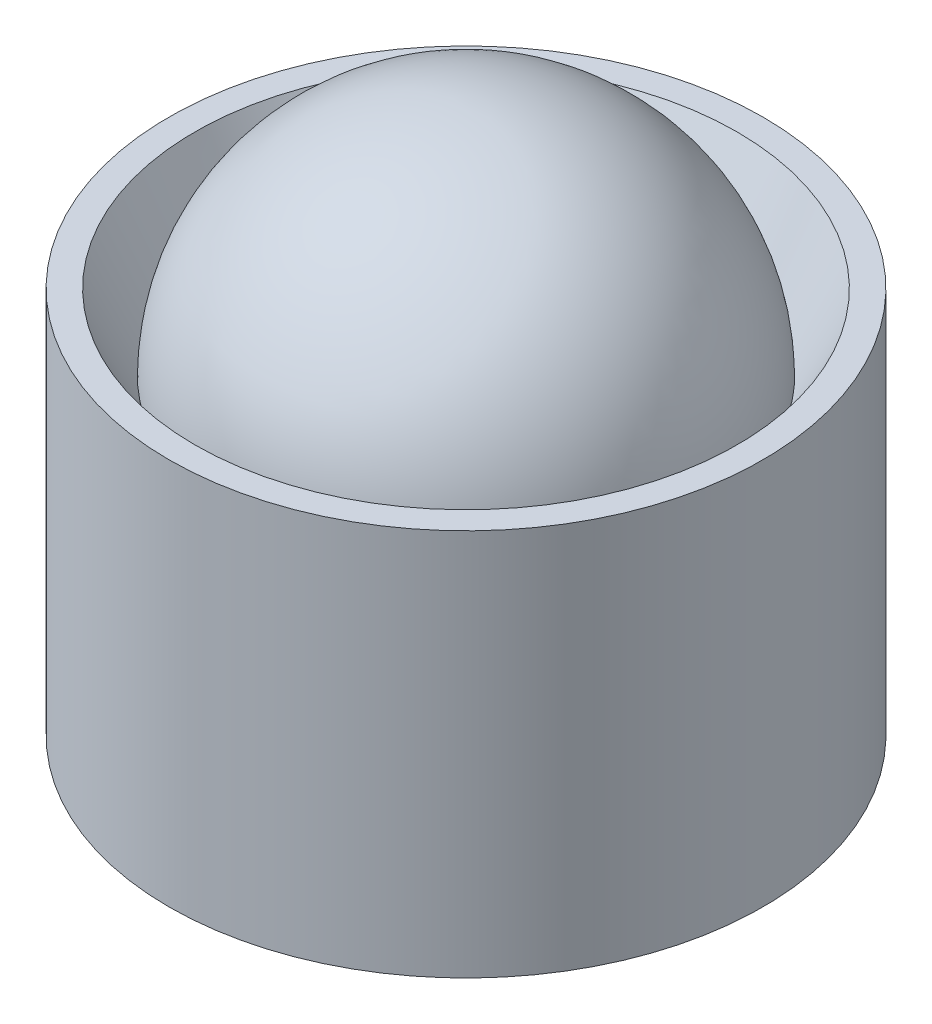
ISO-10303-21;
HEADER;
FILE_DESCRIPTION(('STEP AP214'),'2;1');
FILE_NAME('part.step','',(''),(''),'','','');
FILE_SCHEMA(('AUTOMOTIVE_DESIGN { 1 0 10303 214 1 1 1 1 }'));
ENDSEC;
DATA;
#1=APPLICATION_CONTEXT('core data for automotive mechanical design processes');
#2=APPLICATION_PROTOCOL_DEFINITION('international standard','automotive_design',2000,#1);
#3=PRODUCT_CONTEXT('',#1,'mechanical');
#4=PRODUCT('Part','Part','',(#3));
#5=PRODUCT_RELATED_PRODUCT_CATEGORY('part','',(#4));
#6=PRODUCT_DEFINITION_FORMATION('','',#4);
#7=PRODUCT_DEFINITION_CONTEXT('part definition',#1,'design');
#8=PRODUCT_DEFINITION('design','',#6,#7);
#9=PRODUCT_DEFINITION_SHAPE('','',#8);
#10=(LENGTH_UNIT() NAMED_UNIT(*) SI_UNIT(.MILLI.,.METRE.));
#11=(NAMED_UNIT(*) PLANE_ANGLE_UNIT() SI_UNIT($,.RADIAN.));
#12=(NAMED_UNIT(*) SI_UNIT($,.STERADIAN.) SOLID_ANGLE_UNIT());
#13=UNCERTAINTY_MEASURE_WITH_UNIT(LENGTH_MEASURE(1.E-05),#10,'distance_accuracy_value','');
#14=(GEOMETRIC_REPRESENTATION_CONTEXT(3) GLOBAL_UNCERTAINTY_ASSIGNED_CONTEXT((#13)) GLOBAL_UNIT_ASSIGNED_CONTEXT((#10,
#11,#12)) REPRESENTATION_CONTEXT('',''));
#15=CARTESIAN_POINT('',(0.,0.,0.));
#16=DIRECTION('',(0.,0.,1.));
#17=DIRECTION('',(1.,0.,0.));
#18=AXIS2_PLACEMENT_3D('',#15,#16,#17);
#19=CARTESIAN_POINT('',(0.,12.,0.));
#20=DIRECTION('',(0.,-1.,0.));
#21=DIRECTION('',(0.,0.,-1.));
#22=AXIS2_PLACEMENT_3D('',#19,#20,#21);
#23=SPHERICAL_SURFACE('',#22,9.);
#24=CARTESIAN_POINT('',(0.,12.,0.));
#25=DIRECTION('',(0.,1.,0.));
#26=DIRECTION('',(0.,0.,1.));
#27=AXIS2_PLACEMENT_3D('',#24,#25,#26);
#28=CIRCLE('',#27,9.);
#29=CARTESIAN_POINT('',(0.,12.,9.));
#30=VERTEX_POINT('',#29);
#31=EDGE_CURVE('E11',#30,#30,#28,.T.);
#32=ORIENTED_EDGE('',*,*,#31,.F.);
#33=EDGE_LOOP('',(#32));
#34=FACE_BOUND('',#33,.T.);
#35=ADVANCED_FACE('F46',(#34),#23,.T.);
#36=CARTESIAN_POINT('',(0.,12.,0.));
#37=DIRECTION('',(0.,-1.,0.));
#38=DIRECTION('',(0.,0.,-1.));
#39=AXIS2_PLACEMENT_3D('',#36,#37,#38);
#40=SPHERICAL_SURFACE('',#39,9.);
#41=ORIENTED_EDGE('',*,*,#31,.T.);
#42=EDGE_LOOP('',(#41));
#43=FACE_BOUND('',#42,.T.);
#44=ADVANCED_FACE('F53',(#43),#40,.T.);
#45=CLOSED_SHELL('',(#35,#44));
#46=MANIFOLD_SOLID_BREP('B2',#45);
#47=CARTESIAN_POINT('',(0.,15.,0.));
#48=DIRECTION('',(0.,1.,0.));
#49=DIRECTION('',(0.,0.,1.));
#50=AXIS2_PLACEMENT_3D('',#47,#48,#49);
#51=PLANE('',#50);
#52=CARTESIAN_POINT('',(0.,15.,0.));
#53=DIRECTION('',(0.,1.,0.));
#54=DIRECTION('',(0.,0.,1.));
#55=AXIS2_PLACEMENT_3D('',#52,#53,#54);
#56=CIRCLE('',#55,10.5);
#57=CARTESIAN_POINT('',(0.,15.,10.5));
#58=VERTEX_POINT('',#57);
#59=EDGE_CURVE('E45',#58,#58,#56,.F.);
#60=ORIENTED_EDGE('',*,*,#59,.T.);
#61=EDGE_LOOP('',(#60));
#62=FACE_BOUND('',#61,.T.);
#63=CARTESIAN_POINT('',(0.,15.,0.));
#64=DIRECTION('',(0.,1.,0.));
#65=DIRECTION('',(0.,0.,1.));
#66=AXIS2_PLACEMENT_3D('',#63,#64,#65);
#67=CIRCLE('',#66,11.5);
#68=CARTESIAN_POINT('',(0.,15.,11.5));
#69=VERTEX_POINT('',#68);
#70=EDGE_CURVE('E90',#69,#69,#67,.T.);
#71=ORIENTED_EDGE('',*,*,#70,.T.);
#72=EDGE_LOOP('',(#71));
#73=FACE_BOUND('',#72,.T.);
#74=ADVANCED_FACE('F71',(#62,#73),#51,.T.);
#75=CARTESIAN_POINT('',(0.,0.,0.));
#76=DIRECTION('',(0.,1.,0.));
#77=DIRECTION('',(0.,0.,1.));
#78=AXIS2_PLACEMENT_3D('',#75,#76,#77);
#79=PLANE('',#78);
#80=CARTESIAN_POINT('',(0.,0.,0.));
#81=DIRECTION('',(0.,1.,0.));
#82=DIRECTION('',(0.,0.,1.));
#83=AXIS2_PLACEMENT_3D('',#80,#81,#82);
#84=CIRCLE('',#83,11.5);
#85=CARTESIAN_POINT('',(0.,0.,11.5));
#86=VERTEX_POINT('',#85);
#87=EDGE_CURVE('E129',#86,#86,#84,.T.);
#88=ORIENTED_EDGE('',*,*,#87,.F.);
#89=EDGE_LOOP('',(#88));
#90=FACE_BOUND('',#89,.T.);
#91=CARTESIAN_POINT('',(0.,0.,0.));
#92=DIRECTION('',(0.,1.,0.));
#93=DIRECTION('',(0.,0.,1.));
#94=AXIS2_PLACEMENT_3D('',#91,#92,#93);
#95=CIRCLE('',#94,5.5);
#96=CARTESIAN_POINT('',(0.,0.,5.5));
#97=VERTEX_POINT('',#96);
#98=EDGE_CURVE('E130',#97,#97,#95,.T.);
#99=ORIENTED_EDGE('',*,*,#98,.T.);
#100=EDGE_LOOP('',(#99));
#101=FACE_BOUND('',#100,.T.);
#102=CARTESIAN_POINT('',(7.5,0.,0.));
#103=DIRECTION('',(0.,1.,0.));
#104=DIRECTION('',(0.,0.,1.));
#105=AXIS2_PLACEMENT_3D('',#102,#103,#104);
#106=CIRCLE('',#105,1.25);
#107=CARTESIAN_POINT('',(7.5,0.,1.25));
#108=VERTEX_POINT('',#107);
#109=EDGE_CURVE('E99',#108,#108,#106,.T.);
#110=ORIENTED_EDGE('',*,*,#109,.T.);
#111=EDGE_LOOP('',(#110));
#112=FACE_BOUND('',#111,.T.);
#113=CARTESIAN_POINT('',(-7.5,0.,0.));
#114=DIRECTION('',(0.,1.,0.));
#115=DIRECTION('',(0.,0.,1.));
#116=AXIS2_PLACEMENT_3D('',#113,#114,#115);
#117=CIRCLE('',#116,1.25);
#118=CARTESIAN_POINT('',(-7.5,0.,1.25));
#119=VERTEX_POINT('',#118);
#120=EDGE_CURVE('E100',#119,#119,#117,.T.);
#121=ORIENTED_EDGE('',*,*,#120,.T.);
#122=EDGE_LOOP('',(#121));
#123=FACE_BOUND('',#122,.T.);
#124=ADVANCED_FACE('F117',(#90,#101,#112,#123),#79,.F.);
#125=CARTESIAN_POINT('',(0.,15.,0.));
#126=DIRECTION('',(0.,-1.,0.));
#127=DIRECTION('',(0.,0.,-1.));
#128=AXIS2_PLACEMENT_3D('',#125,#126,#127);
#129=CYLINDRICAL_SURFACE('',#128,11.5);
#130=ORIENTED_EDGE('',*,*,#70,.F.);
#131=EDGE_LOOP('',(#130));
#132=FACE_BOUND('',#131,.T.);
#133=ORIENTED_EDGE('',*,*,#87,.T.);
#134=EDGE_LOOP('',(#133));
#135=FACE_BOUND('',#134,.T.);
#136=ADVANCED_FACE('F113',(#132,#135),#129,.T.);
#137=CARTESIAN_POINT('',(0.,15.,0.));
#138=DIRECTION('',(0.,-1.,0.));
#139=DIRECTION('',(0.,0.,-1.));
#140=AXIS2_PLACEMENT_3D('',#137,#138,#139);
#141=CYLINDRICAL_SURFACE('',#140,5.5);
#142=CARTESIAN_POINT('',(0.,4.99999999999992,0.));
#143=DIRECTION('',(0.,1.,0.));
#144=DIRECTION('',(0.,0.,1.));
#145=AXIS2_PLACEMENT_3D('',#142,#143,#144);
#146=CIRCLE('',#145,5.5);
#147=CARTESIAN_POINT('',(0.,4.99999999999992,5.5));
#148=VERTEX_POINT('',#147);
#149=EDGE_CURVE('E85',#148,#148,#146,.T.);
#150=ORIENTED_EDGE('',*,*,#149,.T.);
#151=EDGE_LOOP('',(#150));
#152=FACE_BOUND('',#151,.T.);
#153=ORIENTED_EDGE('',*,*,#98,.F.);
#154=EDGE_LOOP('',(#153));
#155=FACE_BOUND('',#154,.T.);
#156=ADVANCED_FACE('F109',(#152,#155),#141,.F.);
#157=CARTESIAN_POINT('',(7.5,15.,0.));
#158=DIRECTION('',(0.,-1.,0.));
#159=DIRECTION('',(0.,0.,-1.));
#160=AXIS2_PLACEMENT_3D('',#157,#158,#159);
#161=CYLINDRICAL_SURFACE('',#160,1.25);
#162=CARTESIAN_POINT('',(8.72447577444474,11.4561893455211,-0.251314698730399));
#163=CARTESIAN_POINT('',(8.71440263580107,11.438877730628,-0.300384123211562));
#164=CARTESIAN_POINT('',(8.70167075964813,11.4169710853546,-0.347349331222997));
#165=CARTESIAN_POINT('',(8.67234860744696,11.3663916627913,-0.436252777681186));
#166=CARTESIAN_POINT('',(8.65573842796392,11.337683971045,-0.478163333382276));
#167=CARTESIAN_POINT('',(8.61115344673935,11.2603974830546,-0.576184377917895));
#168=CARTESIAN_POINT('',(8.58158256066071,11.2089484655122,-0.629275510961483));
#169=CARTESIAN_POINT('',(8.5191547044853,11.0997745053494,-0.72604841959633));
#170=CARTESIAN_POINT('',(8.48629270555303,11.0420399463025,-0.769715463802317));
#171=CARTESIAN_POINT('',(8.42094347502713,10.9265979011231,-0.846596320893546));
#172=CARTESIAN_POINT('',(8.38858057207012,10.8691514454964,-0.880316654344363));
#173=CARTESIAN_POINT('',(8.32282611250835,10.75180633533,-0.942068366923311));
#174=CARTESIAN_POINT('',(8.28943369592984,10.691905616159,-0.970094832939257));
#175=CARTESIAN_POINT('',(8.22202355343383,10.5703082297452,-1.02126073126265));
#176=CARTESIAN_POINT('',(8.18800511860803,10.5086094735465,-1.04439419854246));
#177=CARTESIAN_POINT('',(8.11965030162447,10.3839223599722,-1.08634212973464));
#178=CARTESIAN_POINT('',(8.08531381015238,10.320933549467,-1.10515504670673));
#179=CARTESIAN_POINT('',(7.98556113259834,10.1368579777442,-1.15414393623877));
#180=CARTESIAN_POINT('',(7.91998863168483,10.0145091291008,-1.1793061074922));
#181=CARTESIAN_POINT('',(7.78926051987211,9.76771700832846,-1.21797685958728));
#182=CARTESIAN_POINT('',(7.72410534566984,9.64327192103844,-1.23147474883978));
#183=CARTESIAN_POINT('',(7.59444781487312,9.39261665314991,-1.24814699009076));
#184=CARTESIAN_POINT('',(7.52995004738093,9.2664008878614,-1.25127185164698));
#185=CARTESIAN_POINT('',(7.40232528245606,9.0135105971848,-1.24781065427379));
#186=CARTESIAN_POINT('',(7.33919757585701,8.88683635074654,-1.2412297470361));
#187=CARTESIAN_POINT('',(7.20957575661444,8.62338057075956,-1.21771730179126));
#188=CARTESIAN_POINT('',(7.14321714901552,8.48660237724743,-1.19999872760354));
#189=CARTESIAN_POINT('',(7.01267373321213,8.21369214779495,-1.15318631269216));
#190=CARTESIAN_POINT('',(6.94849170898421,8.07756111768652,-1.12407845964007));
#191=CARTESIAN_POINT('',(6.85452028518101,7.8753642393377,-1.07104169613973));
#192=CARTESIAN_POINT('',(6.82367929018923,7.80851851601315,-1.05187972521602));
#193=CARTESIAN_POINT('',(6.76277263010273,7.67555378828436,-1.01012944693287));
#194=CARTESIAN_POINT('',(6.73270679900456,7.60943463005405,-0.987541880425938));
#195=CARTESIAN_POINT('',(6.67353025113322,7.47835682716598,-0.93857329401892));
#196=CARTESIAN_POINT('',(6.64441769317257,7.4133960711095,-0.912200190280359));
#197=CARTESIAN_POINT('',(6.58727718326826,7.28498187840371,-0.855028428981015));
#198=CARTESIAN_POINT('',(6.55924855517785,7.2215275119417,-0.824232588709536));
#199=CARTESIAN_POINT('',(6.51745106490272,7.12623916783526,-0.773057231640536));
#200=CARTESIAN_POINT('',(6.5031831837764,7.0935874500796,-0.754602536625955));
#201=CARTESIAN_POINT('',(6.47510070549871,7.02908597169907,-0.715997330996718));
#202=CARTESIAN_POINT('',(6.46128618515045,6.99723634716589,-0.695846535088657));
#203=CARTESIAN_POINT('',(6.43422727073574,6.93462850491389,-0.653648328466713));
#204=CARTESIAN_POINT('',(6.42098213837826,6.90386888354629,-0.631603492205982));
#205=CARTESIAN_POINT('',(6.39518718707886,6.84375856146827,-0.585312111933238));
#206=CARTESIAN_POINT('',(6.38263704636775,6.81440720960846,-0.561066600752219));
#207=CARTESIAN_POINT('',(6.35628526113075,6.75257738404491,-0.505494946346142));
#208=CARTESIAN_POINT('',(6.34265443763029,6.72046303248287,-0.473674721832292));
#209=CARTESIAN_POINT('',(6.31715084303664,6.66017198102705,-0.40580732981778));
#210=CARTESIAN_POINT('',(6.30527623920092,6.63199117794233,-0.369764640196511));
#211=CARTESIAN_POINT('',(6.28707946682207,6.58868943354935,-0.303564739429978));
#212=CARTESIAN_POINT('',(6.28013061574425,6.57211373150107,-0.274545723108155));
#213=CARTESIAN_POINT('',(6.26808031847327,6.5433259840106,-0.214054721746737));
#214=CARTESIAN_POINT('',(6.26297538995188,6.5311057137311,-0.182587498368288));
#215=CARTESIAN_POINT('',(6.25582756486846,6.51398076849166,-0.123509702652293));
#216=CARTESIAN_POINT('',(6.25340037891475,6.50815874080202,-0.0962155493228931));
#217=CARTESIAN_POINT('',(6.25036544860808,6.50087761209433,-0.0409520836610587));
#218=CARTESIAN_POINT('',(6.24975635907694,6.4994152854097,-0.012983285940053));
#219=CARTESIAN_POINT('',(6.25042157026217,6.50101174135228,0.0428097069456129));
#220=CARTESIAN_POINT('',(6.2516966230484,6.50407232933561,0.0706338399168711));
#221=CARTESIAN_POINT('',(6.25599729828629,6.51438626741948,0.125351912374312));
#222=CARTESIAN_POINT('',(6.25902452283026,6.52164345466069,0.152244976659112));
#223=CARTESIAN_POINT('',(6.26788121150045,6.54284729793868,0.213663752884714));
#224=CARTESIAN_POINT('',(6.27431876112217,6.55824187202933,0.247596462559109));
#225=CARTESIAN_POINT('',(6.28920707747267,6.59375806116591,0.312397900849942));
#226=CARTESIAN_POINT('',(6.29766270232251,6.61389108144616,0.34325897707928));
#227=CARTESIAN_POINT('',(6.32245967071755,6.67276355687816,0.422677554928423));
#228=CARTESIAN_POINT('',(6.3401694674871,6.71464223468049,0.468447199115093));
#229=CARTESIAN_POINT('',(6.37808079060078,6.80378309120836,0.55312908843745));
#230=CARTESIAN_POINT('',(6.39828939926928,6.85106054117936,0.592021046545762));
#231=CARTESIAN_POINT('',(6.44189957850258,6.95247972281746,0.667036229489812));
#232=CARTESIAN_POINT('',(6.46542670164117,7.00687055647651,0.702744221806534));
#233=CARTESIAN_POINT('',(6.51383871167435,7.11805718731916,0.769204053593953));
#234=CARTESIAN_POINT('',(6.53872507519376,7.17485558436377,0.799950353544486));
#235=CARTESIAN_POINT('',(6.58957288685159,7.29013554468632,0.857376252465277));
#236=CARTESIAN_POINT('',(6.61553621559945,7.3486199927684,0.884048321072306));
#237=CARTESIAN_POINT('',(6.66831288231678,7.46670942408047,0.933869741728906));
#238=CARTESIAN_POINT('',(6.69512651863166,7.52631479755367,0.95701784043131));
#239=CARTESIAN_POINT('',(6.75169074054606,7.65121443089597,1.0019695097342));
#240=CARTESIAN_POINT('',(6.78150234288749,7.71657574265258,1.02350888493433));
#241=CARTESIAN_POINT('',(6.84185939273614,7.84795596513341,1.06332294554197));
#242=CARTESIAN_POINT('',(6.87240498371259,7.91397500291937,1.08159698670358));
#243=CARTESIAN_POINT('',(6.96506989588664,8.11282222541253,1.13194941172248));
#244=CARTESIAN_POINT('',(7.02817580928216,8.24634870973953,1.15952609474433));
#245=CARTESIAN_POINT('',(7.15664172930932,8.51435546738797,1.2038353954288));
#246=CARTESIAN_POINT('',(7.22200546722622,8.64883699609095,1.22054905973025));
#247=CARTESIAN_POINT('',(7.35451514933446,8.91773997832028,1.24332293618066));
#248=CARTESIAN_POINT('',(7.42166000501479,9.05216141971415,1.24938950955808));
#249=CARTESIAN_POINT('',(7.54361161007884,9.29307429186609,1.25040767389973));
#250=CARTESIAN_POINT('',(7.59815466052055,9.39969370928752,1.24736639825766));
#251=CARTESIAN_POINT('',(7.70793550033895,9.61209145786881,1.23382460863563));
#252=CARTESIAN_POINT('',(7.7631731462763,9.7178699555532,1.22332561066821));
#253=CARTESIAN_POINT('',(7.87380585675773,9.92762704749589,1.19416436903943));
#254=CARTESIAN_POINT('',(7.92919915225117,10.0316115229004,1.17553833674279));
#255=CARTESIAN_POINT('',(8.03991201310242,10.2374656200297,1.1289840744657));
#256=CARTESIAN_POINT('',(8.09523160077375,10.3393369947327,1.10106391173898));
#257=CARTESIAN_POINT('',(8.19139909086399,10.5148301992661,1.04249421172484));
#258=CARTESIAN_POINT('',(8.23241556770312,10.5891614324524,1.0142617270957));
#259=CARTESIAN_POINT('',(8.31359523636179,10.7353235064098,0.950388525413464));
#260=CARTESIAN_POINT('',(8.3537568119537,10.8071497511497,0.914734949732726));
#261=CARTESIAN_POINT('',(8.43265826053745,10.9474026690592,0.834185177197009));
#262=CARTESIAN_POINT('',(8.47138217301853,11.015793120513,0.789209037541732));
#263=CARTESIAN_POINT('',(8.5454292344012,11.1458428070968,0.688110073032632));
#264=CARTESIAN_POINT('',(8.58076432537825,11.2075257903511,0.632028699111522));
#265=CARTESIAN_POINT('',(8.62951482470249,11.2922451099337,0.536669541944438));
#266=CARTESIAN_POINT('',(8.64526364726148,11.3195398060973,0.502390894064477));
#267=CARTESIAN_POINT('',(8.67440429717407,11.3699420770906,0.429886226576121));
#268=CARTESIAN_POINT('',(8.68779578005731,11.3930490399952,0.39165963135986));
#269=CARTESIAN_POINT('',(8.71149022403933,11.4338704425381,0.31078387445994));
#270=CARTESIAN_POINT('',(8.72175054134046,11.4515104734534,0.268083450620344));
#271=CARTESIAN_POINT('',(8.73785826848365,11.4791788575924,0.179492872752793));
#272=CARTESIAN_POINT('',(8.74371489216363,11.4892231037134,0.133609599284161));
#273=CARTESIAN_POINT('',(8.74980358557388,11.4996639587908,0.0463919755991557));
#274=CARTESIAN_POINT('',(8.75066117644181,11.5011335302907,0.00522979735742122));
#275=CARTESIAN_POINT('',(8.74831940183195,11.4971188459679,-0.0766166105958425));
#276=CARTESIAN_POINT('',(8.74512389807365,11.4916412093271,-0.117301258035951));
#277=CARTESIAN_POINT('',(8.73806717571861,11.4795320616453,-0.173076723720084));
#278=CARTESIAN_POINT('',(8.73573297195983,11.4755256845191,-0.188994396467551));
#279=CARTESIAN_POINT('',(8.73051054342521,11.4665581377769,-0.220447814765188));
#280=CARTESIAN_POINT('',(8.72762292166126,11.4615980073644,-0.235983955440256));
#281=CARTESIAN_POINT('',(8.72447577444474,11.4561893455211,-0.251314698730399));
#282=B_SPLINE_CURVE_WITH_KNOTS('',3,(#162,#163,#164,#165,#166,#167,#168,#169,#170,#171,#172,
#173,#174,#175,#176,#177,#178,#179,#180,#181,#182,#183,#184,#185,#186,#187,#188,#189,#190,#191,
#192,#193,#194,#195,#196,#197,#198,#199,#200,#201,#202,#203,#204,#205,#206,#207,#208,#209,#210,
#211,#212,#213,#214,#215,#216,#217,#218,#219,#220,#221,#222,#223,#224,#225,#226,#227,#228,#229,
#230,#231,#232,#233,#234,#235,#236,#237,#238,#239,#240,#241,#242,#243,#244,#245,#246,#247,#248,
#249,#250,#251,#252,#253,#254,#255,#256,#257,#258,#259,#260,#261,#262,#263,#264,#265,#266,#267,
#268,#269,#270,#271,#272,#273,#274,#275,#276,#277,#278,#279,#280,#281),.UNSPECIFIED.,.T.,.F.,(4,
2,2,2,2,2,2,2,2,2,2,2,2,2,2,2,2,2,2,2,2,2,2,2,2,2,2,2,2,2,2,2,2,2,2,2,2,2,2,2,2,2,2,2,2,2,2,2,2,
2,2,2,2,2,2,2,2,2,2,4),(0.,0.158925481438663,0.318685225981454,0.556216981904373,
0.794117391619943,1.01596550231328,1.23800423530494,1.46031211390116,1.6826994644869,
2.10525607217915,2.52819958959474,2.95315812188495,3.37789117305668,3.83665328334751,
4.29598159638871,4.52412682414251,4.75222278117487,4.97984852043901,5.2073298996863,
5.32767819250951,5.44804676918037,5.56825424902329,5.6884056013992,5.82979185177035,
5.9710294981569,6.07311471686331,6.17500612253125,6.2586793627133,6.34229067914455,
6.42593537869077,6.50965667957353,6.62245478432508,6.73552721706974,6.92798658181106,
7.12100450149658,7.32824620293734,7.53571770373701,7.74356814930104,7.9514923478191,
8.17639731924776,8.40134661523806,8.85156137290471,9.30255955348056,9.75328818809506,
10.1124777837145,10.4715943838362,10.829126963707,11.1863500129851,11.4544880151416,
11.7230945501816,11.994107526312,12.2641273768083,12.4034959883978,12.5428849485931,
12.6840952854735,12.8250093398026,12.9478339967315,13.0705417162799,13.1202486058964,
13.1699016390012),.UNSPECIFIED.);
#283=CARTESIAN_POINT('',(8.72447577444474,11.4561893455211,-0.251314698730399));
#284=VERTEX_POINT('',#283);
#285=EDGE_CURVE('E77',#284,#284,#282,.T.);
#286=ORIENTED_EDGE('',*,*,#285,.T.);
#287=EDGE_LOOP('',(#286));
#288=FACE_BOUND('',#287,.T.);
#289=ORIENTED_EDGE('',*,*,#109,.F.);
#290=EDGE_LOOP('',(#289));
#291=FACE_BOUND('',#290,.T.);
#292=ADVANCED_FACE('F104',(#288,#291),#161,.F.);
#293=CARTESIAN_POINT('',(-7.5,15.,0.));
#294=DIRECTION('',(0.,-1.,0.));
#295=DIRECTION('',(0.,0.,-1.));
#296=AXIS2_PLACEMENT_3D('',#293,#294,#295);
#297=CYLINDRICAL_SURFACE('',#296,1.25);
#298=CARTESIAN_POINT('',(-8.72447577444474,11.4561893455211,-0.251314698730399));
#299=CARTESIAN_POINT('',(-8.73204363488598,11.4691954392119,-0.214432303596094));
#300=CARTESIAN_POINT('',(-8.73812703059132,11.4796359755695,-0.176288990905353));
#301=CARTESIAN_POINT('',(-8.74673214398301,11.4943986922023,-0.0984379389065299));
#302=CARTESIAN_POINT('',(-8.74925526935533,11.4987232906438,-0.0587308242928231));
#303=CARTESIAN_POINT('',(-8.75046028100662,11.5007890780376,0.0210191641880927));
#304=CARTESIAN_POINT('',(-8.74913286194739,11.4985143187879,0.0610626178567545));
#305=CARTESIAN_POINT('',(-8.74277153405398,11.4876047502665,0.139965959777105));
#306=CARTESIAN_POINT('',(-8.73773481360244,11.478965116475,0.178824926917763));
#307=CARTESIAN_POINT('',(-8.72353444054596,11.4545762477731,0.259561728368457));
#308=CARTESIAN_POINT('',(-8.71389177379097,11.4380010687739,0.301100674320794));
#309=CARTESIAN_POINT('',(-8.69139464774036,11.3992544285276,0.380513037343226));
#310=CARTESIAN_POINT('',(-8.67853523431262,11.3770743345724,0.418380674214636));
#311=CARTESIAN_POINT('',(-8.643188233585,11.3159648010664,0.508983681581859));
#312=CARTESIAN_POINT('',(-8.61916377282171,11.2743107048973,0.559259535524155));
#313=CARTESIAN_POINT('',(-8.567797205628,11.1848726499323,0.652021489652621));
#314=CARTESIAN_POINT('',(-8.54044678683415,11.1370733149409,0.694487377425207));
#315=CARTESIAN_POINT('',(-8.48641440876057,11.0422093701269,0.769020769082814));
#316=CARTESIAN_POINT('',(-8.45991603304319,10.9955068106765,0.801692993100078));
#317=CARTESIAN_POINT('',(-8.40581110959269,10.8997326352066,0.862356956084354));
#318=CARTESIAN_POINT('',(-8.37820367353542,10.8506591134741,0.890344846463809));
#319=CARTESIAN_POINT('',(-8.32224553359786,10.750738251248,0.942268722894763));
#320=CARTESIAN_POINT('',(-8.29389388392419,10.6998886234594,0.966199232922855));
#321=CARTESIAN_POINT('',(-8.23673269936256,10.5968858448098,1.01046013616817));
#322=CARTESIAN_POINT('',(-8.20792299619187,10.5447322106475,1.03078917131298));
#323=CARTESIAN_POINT('',(-8.12279104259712,10.3898714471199,1.08587489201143));
#324=CARTESIAN_POINT('',(-8.06609516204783,10.2857838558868,1.11620235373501));
#325=CARTESIAN_POINT('',(-7.95254631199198,10.0752571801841,1.16685908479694));
#326=CARTESIAN_POINT('',(-7.89569324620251,9.9688160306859,1.18717917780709));
#327=CARTESIAN_POINT('',(-7.78220517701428,9.75416949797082,1.21915698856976));
#328=CARTESIAN_POINT('',(-7.72557117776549,9.64596012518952,1.23079115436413));
#329=CARTESIAN_POINT('',(-7.61300595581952,9.42861559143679,1.24617584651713));
#330=CARTESIAN_POINT('',(-7.55707489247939,9.31948022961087,1.24992461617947));
#331=CARTESIAN_POINT('',(-7.42671342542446,9.06235740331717,1.25009935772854));
#332=CARTESIAN_POINT('',(-7.35267224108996,8.91416338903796,1.24349714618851));
#333=CARTESIAN_POINT('',(-7.20675187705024,8.61769896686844,1.2173752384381));
#334=CARTESIAN_POINT('',(-7.1348748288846,8.46942862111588,1.19784321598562));
#335=CARTESIAN_POINT('',(-6.99389072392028,8.174102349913,1.14543450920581));
#336=CARTESIAN_POINT('',(-6.92478002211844,8.02704504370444,1.11257606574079));
#337=CARTESIAN_POINT('',(-6.82368652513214,7.80856642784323,1.05196461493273));
#338=CARTESIAN_POINT('',(-6.790436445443,7.73613385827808,1.02988997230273));
#339=CARTESIAN_POINT('',(-6.72490378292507,7.59225481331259,0.981523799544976));
#340=CARTESIAN_POINT('',(-6.692620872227,7.52080800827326,0.955233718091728));
#341=CARTESIAN_POINT('',(-6.63688803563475,7.39649795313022,0.904757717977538));
#342=CARTESIAN_POINT('',(-6.6131928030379,7.34332560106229,0.881604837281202));
#343=CARTESIAN_POINT('',(-6.56657521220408,7.23809952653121,0.832091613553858));
#344=CARTESIAN_POINT('',(-6.54365318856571,7.18604629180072,0.805729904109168));
#345=CARTESIAN_POINT('',(-6.49891331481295,7.08386007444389,0.749408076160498));
#346=CARTESIAN_POINT('',(-6.47708990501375,7.03371782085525,0.719469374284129));
#347=CARTESIAN_POINT('',(-6.434729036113,6.93584653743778,0.655121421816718));
#348=CARTESIAN_POINT('',(-6.41419000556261,6.88811457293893,0.620717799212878));
#349=CARTESIAN_POINT('',(-6.38139328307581,6.81150057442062,0.558579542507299));
#350=CARTESIAN_POINT('',(-6.36863723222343,6.78159075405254,0.532383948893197));
#351=CARTESIAN_POINT('',(-6.34418793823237,6.72407568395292,0.476987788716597));
#352=CARTESIAN_POINT('',(-6.33249630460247,6.69647392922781,0.447782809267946));
#353=CARTESIAN_POINT('',(-6.31050607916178,6.64440778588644,0.385621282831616));
#354=CARTESIAN_POINT('',(-6.30022265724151,6.61997769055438,0.352630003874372));
#355=CARTESIAN_POINT('',(-6.28188063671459,6.57629971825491,0.282803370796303));
#356=CARTESIAN_POINT('',(-6.27381591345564,6.55703757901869,0.245978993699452));
#357=CARTESIAN_POINT('',(-6.26288147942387,6.5308820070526,0.180979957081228));
#358=CARTESIAN_POINT('',(-6.25917542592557,6.52200344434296,0.153753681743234));
#359=CARTESIAN_POINT('',(-6.25354193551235,6.5084996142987,0.0980896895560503));
#360=CARTESIAN_POINT('',(-6.25161230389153,6.50386909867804,0.0696535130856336));
#361=CARTESIAN_POINT('',(-6.24972809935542,6.49934766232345,0.0122013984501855));
#362=CARTESIAN_POINT('',(-6.24978237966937,6.49947798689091,-0.0168165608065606));
#363=CARTESIAN_POINT('',(-6.25188096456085,6.5045137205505,-0.0743643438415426));
#364=CARTESIAN_POINT('',(-6.25392663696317,6.50942241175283,-0.102893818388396));
#365=CARTESIAN_POINT('',(-6.26031358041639,6.52473080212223,-0.163607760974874));
#366=CARTESIAN_POINT('',(-6.26499682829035,6.53594801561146,-0.195546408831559));
#367=CARTESIAN_POINT('',(-6.27630911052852,6.56299046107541,-0.257027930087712));
#368=CARTESIAN_POINT('',(-6.28294185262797,6.57882447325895,-0.286566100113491));
#369=CARTESIAN_POINT('',(-6.30196876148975,6.62413906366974,-0.359684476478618));
#370=CARTESIAN_POINT('',(-6.31546309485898,6.65618316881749,-0.401366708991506));
#371=CARTESIAN_POINT('',(-6.34475970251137,6.72543883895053,-0.479225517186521));
#372=CARTESIAN_POINT('',(-6.36056844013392,6.76266486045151,-0.51538607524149));
#373=CARTESIAN_POINT('',(-6.39398489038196,6.84097550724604,-0.583690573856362));
#374=CARTESIAN_POINT('',(-6.41161692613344,6.8821114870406,-0.615762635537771));
#375=CARTESIAN_POINT('',(-6.44803135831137,6.96663691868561,-0.676094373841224));
#376=CARTESIAN_POINT('',(-6.46681492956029,7.01002866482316,-0.704350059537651));
#377=CARTESIAN_POINT('',(-6.50528060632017,7.0984271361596,-0.757704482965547));
#378=CARTESIAN_POINT('',(-6.52496420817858,7.14343652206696,-0.782797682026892));
#379=CARTESIAN_POINT('',(-6.56503507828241,7.23458300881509,-0.830242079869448));
#380=CARTESIAN_POINT('',(-6.58542261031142,7.28072053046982,-0.852592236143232));
#381=CARTESIAN_POINT('',(-6.65307245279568,7.43300016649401,-0.921820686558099));
#382=CARTESIAN_POINT('',(-6.70155027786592,7.54085851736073,-0.963759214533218));
#383=CARTESIAN_POINT('',(-6.80075171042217,7.75888944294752,-1.03796519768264));
#384=CARTESIAN_POINT('',(-6.85147779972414,7.86906450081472,-1.07022164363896));
#385=CARTESIAN_POINT('',(-6.95486451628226,8.09092616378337,-1.12640789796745));
#386=CARTESIAN_POINT('',(-7.00752921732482,8.20261559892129,-1.15031891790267));
#387=CARTESIAN_POINT('',(-7.11441983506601,8.42663318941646,-1.19041313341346));
#388=CARTESIAN_POINT('',(-7.16864596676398,8.53896143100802,-1.2065952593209));
#389=CARTESIAN_POINT('',(-7.28559423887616,8.77842313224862,-1.23311790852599));
#390=CARTESIAN_POINT('',(-7.34850358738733,8.90558073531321,-1.242424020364));
#391=CARTESIAN_POINT('',(-7.47578100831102,9.15958434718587,-1.25139315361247));
#392=CARTESIAN_POINT('',(-7.54014973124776,9.28643018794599,-1.25105178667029));
#393=CARTESIAN_POINT('',(-7.66969567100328,9.53858317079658,-1.24012564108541));
#394=CARTESIAN_POINT('',(-7.73486813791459,9.66389461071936,-1.22958553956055));
#395=CARTESIAN_POINT('',(-7.86579326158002,9.91266897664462,-1.19718306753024));
#396=CARTESIAN_POINT('',(-7.93154536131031,10.0361334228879,-1.17533060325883));
#397=CARTESIAN_POINT('',(-8.04792901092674,10.25221881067,-1.12486510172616));
#398=CARTESIAN_POINT('',(-8.09858727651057,10.3454492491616,-1.0989325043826));
#399=CARTESIAN_POINT('',(-8.19938455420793,10.529413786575,-1.0377165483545));
#400=CARTESIAN_POINT('',(-8.24952258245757,10.6201435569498,-1.00241797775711));
#401=CARTESIAN_POINT('',(-8.32374284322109,10.7534050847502,-0.940738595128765));
#402=CARTESIAN_POINT('',(-8.34843826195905,10.7975649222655,-0.918591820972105));
#403=CARTESIAN_POINT('',(-8.39720350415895,10.8844334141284,-0.871026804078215));
#404=CARTESIAN_POINT('',(-8.42127360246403,10.9271427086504,-0.845610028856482));
#405=CARTESIAN_POINT('',(-8.46847892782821,11.0105988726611,-0.791104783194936));
#406=CARTESIAN_POINT('',(-8.49161558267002,11.0513487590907,-0.762022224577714));
#407=CARTESIAN_POINT('',(-8.53656244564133,11.130245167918,-0.699652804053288));
#408=CARTESIAN_POINT('',(-8.55837403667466,11.1683944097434,-0.666370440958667));
#409=CARTESIAN_POINT('',(-8.6007701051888,11.2423204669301,-0.593827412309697));
#410=CARTESIAN_POINT('',(-8.62129119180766,11.2779790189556,-0.554406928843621));
#411=CARTESIAN_POINT('',(-8.65922034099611,11.3437104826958,-0.46993054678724));
#412=CARTESIAN_POINT('',(-8.67664118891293,11.3738063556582,-0.424899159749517));
#413=CARTESIAN_POINT('',(-8.69810769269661,11.4108179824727,-0.357038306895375));
#414=CARTESIAN_POINT('',(-8.70403011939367,11.4210188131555,-0.336569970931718));
#415=CARTESIAN_POINT('',(-8.71496869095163,11.4398454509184,-0.294654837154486));
#416=CARTESIAN_POINT('',(-8.71998373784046,11.4484693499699,-0.27320689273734));
#417=CARTESIAN_POINT('',(-8.72447577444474,11.4561893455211,-0.251314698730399));
#418=B_SPLINE_CURVE_WITH_KNOTS('',3,(#298,#299,#300,#301,#302,#303,#304,#305,#306,#307,#308,
#309,#310,#311,#312,#313,#314,#315,#316,#317,#318,#319,#320,#321,#322,#323,#324,#325,#326,#327,
#328,#329,#330,#331,#332,#333,#334,#335,#336,#337,#338,#339,#340,#341,#342,#343,#344,#345,#346,
#347,#348,#349,#350,#351,#352,#353,#354,#355,#356,#357,#358,#359,#360,#361,#362,#363,#364,#365,
#366,#367,#368,#369,#370,#371,#372,#373,#374,#375,#376,#377,#378,#379,#380,#381,#382,#383,#384,
#385,#386,#387,#388,#389,#390,#391,#392,#393,#394,#395,#396,#397,#398,#399,#400,#401,#402,#403,
#404,#405,#406,#407,#408,#409,#410,#411,#412,#413,#414,#415,#416,#417),.UNSPECIFIED.,.T.,.F.,(4,
2,2,2,2,2,2,2,2,2,2,2,2,2,2,2,2,2,2,2,2,2,2,2,2,2,2,2,2,2,2,2,2,2,2,2,2,2,2,2,2,2,2,2,2,2,2,2,2,
2,2,2,2,2,2,2,2,2,2,4),(0.,0.119412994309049,0.238778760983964,0.358433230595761,
0.478178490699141,0.614686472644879,0.751405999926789,0.958947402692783,1.1670185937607,
1.35531155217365,1.54375845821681,1.73245771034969,1.92122796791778,2.28766801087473,
2.6544434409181,3.02220980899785,3.39005809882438,3.88687438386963,4.38416497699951,
4.88077717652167,5.12878873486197,5.37671524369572,5.56458304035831,5.75253111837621,
5.93940552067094,6.12604661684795,6.25117475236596,6.37648905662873,6.50306191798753,
6.62928179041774,6.71557685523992,6.80176516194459,6.88833813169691,6.97497060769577,
7.07692296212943,7.17907048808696,7.3409935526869,7.50337775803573,7.66830839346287,
7.83341018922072,7.99879723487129,8.16424694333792,8.54003277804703,8.91624430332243,
9.29329742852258,9.67040272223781,10.0965889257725,10.5229689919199,10.9474896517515,
11.3716391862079,11.6990052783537,12.0269063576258,12.1925052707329,12.3580301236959,
12.5232913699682,12.6883770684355,12.8588574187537,13.0286175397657,13.0994121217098,
13.1702918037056),.UNSPECIFIED.);
#419=CARTESIAN_POINT('',(-8.72447577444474,11.4561893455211,-0.251314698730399));
#420=VERTEX_POINT('',#419);
#421=EDGE_CURVE('E93',#420,#420,#418,.T.);
#422=ORIENTED_EDGE('',*,*,#421,.T.);
#423=EDGE_LOOP('',(#422));
#424=FACE_BOUND('',#423,.T.);
#425=ORIENTED_EDGE('',*,*,#120,.F.);
#426=EDGE_LOOP('',(#425));
#427=FACE_BOUND('',#426,.T.);
#428=ADVANCED_FACE('F101',(#424,#427),#297,.F.);
#429=CARTESIAN_POINT('',(0.,4.99999999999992,0.));
#430=DIRECTION('',(0.,1.,0.));
#431=DIRECTION('',(0.,0.,1.));
#432=AXIS2_PLACEMENT_3D('',#429,#430,#431);
#433=CONICAL_SURFACE('',#432,5.5,0.463647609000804);
#434=ORIENTED_EDGE('',*,*,#59,.F.);
#435=EDGE_LOOP('',(#434));
#436=FACE_BOUND('',#435,.T.);
#437=ORIENTED_EDGE('',*,*,#149,.F.);
#438=EDGE_LOOP('',(#437));
#439=FACE_BOUND('',#438,.T.);
#440=ORIENTED_EDGE('',*,*,#421,.F.);
#441=EDGE_LOOP('',(#440));
#442=FACE_BOUND('',#441,.T.);
#443=ORIENTED_EDGE('',*,*,#285,.F.);
#444=EDGE_LOOP('',(#443));
#445=FACE_BOUND('',#444,.T.);
#446=ADVANCED_FACE('F74',(#436,#439,#442,#445),#433,.F.);
#447=CLOSED_SHELL('',(#74,#124,#136,#156,#292,#428,#446));
#448=MANIFOLD_SOLID_BREP('B6',#447);
#449=ADVANCED_BREP_SHAPE_REPRESENTATION('',(#18,#46,#448),#14);
#450=SHAPE_DEFINITION_REPRESENTATION(#9,#449);
ENDSEC;
END-ISO-10303-21;
